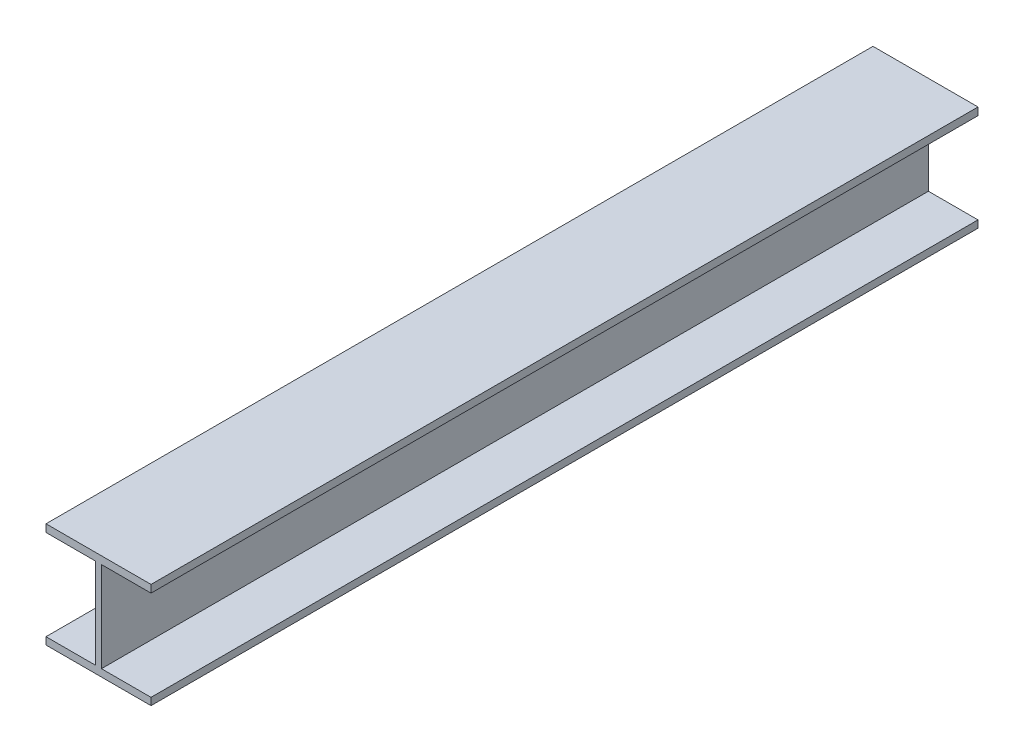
ISO-10303-21;
HEADER;
FILE_DESCRIPTION(('STEP AP214'),'2;1');
FILE_NAME('part.step','',(''),(''),'','','');
FILE_SCHEMA(('AUTOMOTIVE_DESIGN { 1 0 10303 214 1 1 1 1 }'));
ENDSEC;
DATA;
#1=APPLICATION_CONTEXT('core data for automotive mechanical design processes');
#2=APPLICATION_PROTOCOL_DEFINITION('international standard','automotive_design',2000,#1);
#3=PRODUCT_CONTEXT('',#1,'mechanical');
#4=PRODUCT('Part','Part','',(#3));
#5=PRODUCT_RELATED_PRODUCT_CATEGORY('part','',(#4));
#6=PRODUCT_DEFINITION_FORMATION('','',#4);
#7=PRODUCT_DEFINITION_CONTEXT('part definition',#1,'design');
#8=PRODUCT_DEFINITION('design','',#6,#7);
#9=PRODUCT_DEFINITION_SHAPE('','',#8);
#10=(LENGTH_UNIT() NAMED_UNIT(*) SI_UNIT(.MILLI.,.METRE.));
#11=(NAMED_UNIT(*) PLANE_ANGLE_UNIT() SI_UNIT($,.RADIAN.));
#12=(NAMED_UNIT(*) SI_UNIT($,.STERADIAN.) SOLID_ANGLE_UNIT());
#13=UNCERTAINTY_MEASURE_WITH_UNIT(LENGTH_MEASURE(1.E-05),#10,'distance_accuracy_value','');
#14=(GEOMETRIC_REPRESENTATION_CONTEXT(3) GLOBAL_UNCERTAINTY_ASSIGNED_CONTEXT((#13)) GLOBAL_UNIT_ASSIGNED_CONTEXT((#10,
#11,#12)) REPRESENTATION_CONTEXT('',''));
#15=CARTESIAN_POINT('',(0.,0.,0.));
#16=DIRECTION('',(0.,0.,1.));
#17=DIRECTION('',(1.,0.,0.));
#18=AXIS2_PLACEMENT_3D('',#15,#16,#17);
#19=CARTESIAN_POINT('',(63.5,54.36,1000.));
#20=DIRECTION('',(-1.,0.,0.));
#21=DIRECTION('',(0.,0.,1.));
#22=AXIS2_PLACEMENT_3D('',#19,#20,#21);
#23=PLANE('',#22);
#24=DIRECTION('',(0.,1.,0.));
#25=VECTOR('',#24,1.);
#26=CARTESIAN_POINT('',(63.5,54.36,0.));
#27=LINE('',#26,#25);
#28=CARTESIAN_POINT('',(63.5,54.36,0.));
#29=VERTEX_POINT('',#28);
#30=CARTESIAN_POINT('',(63.5,63.5,0.));
#31=VERTEX_POINT('',#30);
#32=EDGE_CURVE('E170',#29,#31,#27,.T.);
#33=ORIENTED_EDGE('',*,*,#32,.T.);
#34=DIRECTION('',(0.,0.,-1.));
#35=VECTOR('',#34,1.);
#36=CARTESIAN_POINT('',(63.5,63.5,1000.));
#37=LINE('',#36,#35);
#38=CARTESIAN_POINT('',(63.5,63.5,1000.));
#39=VERTEX_POINT('',#38);
#40=EDGE_CURVE('E11',#39,#31,#37,.T.);
#41=ORIENTED_EDGE('',*,*,#40,.F.);
#42=DIRECTION('',(0.,1.,0.));
#43=VECTOR('',#42,1.);
#44=CARTESIAN_POINT('',(63.5,54.36,1000.));
#45=LINE('',#44,#43);
#46=CARTESIAN_POINT('',(63.5,54.36,1000.));
#47=VERTEX_POINT('',#46);
#48=EDGE_CURVE('E204',#47,#39,#45,.T.);
#49=ORIENTED_EDGE('',*,*,#48,.F.);
#50=DIRECTION('',(0.,0.,-1.));
#51=VECTOR('',#50,1.);
#52=CARTESIAN_POINT('',(63.5,54.36,1000.));
#53=LINE('',#52,#51);
#54=EDGE_CURVE('E166',#47,#29,#53,.T.);
#55=ORIENTED_EDGE('',*,*,#54,.T.);
#56=EDGE_LOOP('',(#33,#41,#49,#55));
#57=FACE_BOUND('',#56,.T.);
#58=ADVANCED_FACE('F45',(#57),#23,.F.);
#59=CARTESIAN_POINT('',(-63.5,63.5,1000.));
#60=DIRECTION('',(0.,-1.,0.));
#61=DIRECTION('',(0.,0.,-1.));
#62=AXIS2_PLACEMENT_3D('',#59,#60,#61);
#63=PLANE('',#62);
#64=DIRECTION('',(-1.,0.,0.));
#65=VECTOR('',#64,1.);
#66=CARTESIAN_POINT('',(-63.5,63.5,0.));
#67=LINE('',#66,#65);
#68=CARTESIAN_POINT('',(-63.5,63.5,0.));
#69=VERTEX_POINT('',#68);
#70=EDGE_CURVE('E174',#31,#69,#67,.T.);
#71=ORIENTED_EDGE('',*,*,#70,.T.);
#72=DIRECTION('',(0.,0.,-1.));
#73=VECTOR('',#72,1.);
#74=CARTESIAN_POINT('',(-63.5,63.5,1000.));
#75=LINE('',#74,#73);
#76=CARTESIAN_POINT('',(-63.5,63.5,1000.));
#77=VERTEX_POINT('',#76);
#78=EDGE_CURVE('E54',#77,#69,#75,.T.);
#79=ORIENTED_EDGE('',*,*,#78,.F.);
#80=DIRECTION('',(-1.,0.,0.));
#81=VECTOR('',#80,1.);
#82=CARTESIAN_POINT('',(-63.5,63.5,1000.));
#83=LINE('',#82,#81);
#84=EDGE_CURVE('E117',#39,#77,#83,.T.);
#85=ORIENTED_EDGE('',*,*,#84,.F.);
#86=ORIENTED_EDGE('',*,*,#40,.T.);
#87=EDGE_LOOP('',(#71,#79,#85,#86));
#88=FACE_BOUND('',#87,.T.);
#89=ADVANCED_FACE('F298',(#88),#63,.F.);
#90=CARTESIAN_POINT('',(-63.5,54.36,1000.));
#91=DIRECTION('',(1.,0.,0.));
#92=DIRECTION('',(0.,0.,-1.));
#93=AXIS2_PLACEMENT_3D('',#90,#91,#92);
#94=PLANE('',#93);
#95=DIRECTION('',(0.,-1.,0.));
#96=VECTOR('',#95,1.);
#97=CARTESIAN_POINT('',(-63.5,54.36,0.));
#98=LINE('',#97,#96);
#99=CARTESIAN_POINT('',(-63.5,54.36,0.));
#100=VERTEX_POINT('',#99);
#101=EDGE_CURVE('E177',#69,#100,#98,.T.);
#102=ORIENTED_EDGE('',*,*,#101,.T.);
#103=DIRECTION('',(0.,0.,-1.));
#104=VECTOR('',#103,1.);
#105=CARTESIAN_POINT('',(-63.5,54.36,1000.));
#106=LINE('',#105,#104);
#107=CARTESIAN_POINT('',(-63.5,54.36,1000.));
#108=VERTEX_POINT('',#107);
#109=EDGE_CURVE('E231',#108,#100,#106,.T.);
#110=ORIENTED_EDGE('',*,*,#109,.F.);
#111=DIRECTION('',(0.,-1.,0.));
#112=VECTOR('',#111,1.);
#113=CARTESIAN_POINT('',(-63.5,54.36,1000.));
#114=LINE('',#113,#112);
#115=EDGE_CURVE('E241',#77,#108,#114,.T.);
#116=ORIENTED_EDGE('',*,*,#115,.F.);
#117=ORIENTED_EDGE('',*,*,#78,.T.);
#118=EDGE_LOOP('',(#102,#110,#116,#117));
#119=FACE_BOUND('',#118,.T.);
#120=ADVANCED_FACE('F239',(#119),#94,.F.);
#121=CARTESIAN_POINT('',(-3.55500000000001,54.36,1000.));
#122=DIRECTION('',(0.,1.,0.));
#123=DIRECTION('',(-1.,0.,0.));
#124=AXIS2_PLACEMENT_3D('',#121,#122,#123);
#125=PLANE('',#124);
#126=DIRECTION('',(1.,0.,0.));
#127=VECTOR('',#126,1.);
#128=CARTESIAN_POINT('',(-3.55500000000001,54.36,0.));
#129=LINE('',#128,#127);
#130=CARTESIAN_POINT('',(-3.55500000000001,54.36,0.));
#131=VERTEX_POINT('',#130);
#132=EDGE_CURVE('E180',#100,#131,#129,.T.);
#133=ORIENTED_EDGE('',*,*,#132,.T.);
#134=DIRECTION('',(0.,0.,-1.));
#135=VECTOR('',#134,1.);
#136=CARTESIAN_POINT('',(-3.55500000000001,54.36,1000.));
#137=LINE('',#136,#135);
#138=CARTESIAN_POINT('',(-3.55500000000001,54.36,1000.));
#139=VERTEX_POINT('',#138);
#140=EDGE_CURVE('E227',#139,#131,#137,.T.);
#141=ORIENTED_EDGE('',*,*,#140,.F.);
#142=DIRECTION('',(1.,0.,0.));
#143=VECTOR('',#142,1.);
#144=CARTESIAN_POINT('',(-3.55500000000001,54.36,1000.));
#145=LINE('',#144,#143);
#146=EDGE_CURVE('E260',#108,#139,#145,.T.);
#147=ORIENTED_EDGE('',*,*,#146,.F.);
#148=ORIENTED_EDGE('',*,*,#109,.T.);
#149=EDGE_LOOP('',(#133,#141,#147,#148));
#150=FACE_BOUND('',#149,.T.);
#151=ADVANCED_FACE('F250',(#150),#125,.F.);
#152=CARTESIAN_POINT('',(-3.55500000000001,54.36,1000.));
#153=DIRECTION('',(1.,0.,0.));
#154=DIRECTION('',(0.,1.,0.));
#155=AXIS2_PLACEMENT_3D('',#152,#153,#154);
#156=PLANE('',#155);
#157=DIRECTION('',(0.,-1.,0.));
#158=VECTOR('',#157,1.);
#159=CARTESIAN_POINT('',(-3.55500000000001,54.36,0.));
#160=LINE('',#159,#158);
#161=CARTESIAN_POINT('',(-3.55499999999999,-54.74,0.));
#162=VERTEX_POINT('',#161);
#163=EDGE_CURVE('E183',#131,#162,#160,.T.);
#164=ORIENTED_EDGE('',*,*,#163,.T.);
#165=DIRECTION('',(0.,0.,-1.));
#166=VECTOR('',#165,1.);
#167=CARTESIAN_POINT('',(-3.55499999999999,-54.74,1000.));
#168=LINE('',#167,#166);
#169=CARTESIAN_POINT('',(-3.55499999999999,-54.74,1000.));
#170=VERTEX_POINT('',#169);
#171=EDGE_CURVE('E223',#170,#162,#168,.T.);
#172=ORIENTED_EDGE('',*,*,#171,.F.);
#173=DIRECTION('',(0.,-1.,0.));
#174=VECTOR('',#173,1.);
#175=CARTESIAN_POINT('',(-3.55500000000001,54.36,1000.));
#176=LINE('',#175,#174);
#177=EDGE_CURVE('E256',#139,#170,#176,.T.);
#178=ORIENTED_EDGE('',*,*,#177,.F.);
#179=ORIENTED_EDGE('',*,*,#140,.T.);
#180=EDGE_LOOP('',(#164,#172,#178,#179));
#181=FACE_BOUND('',#180,.T.);
#182=ADVANCED_FACE('F254',(#181),#156,.F.);
#183=CARTESIAN_POINT('',(-63.5,-54.74,1000.));
#184=DIRECTION('',(0.,-1.,0.));
#185=DIRECTION('',(1.,0.,0.));
#186=AXIS2_PLACEMENT_3D('',#183,#184,#185);
#187=PLANE('',#186);
#188=DIRECTION('',(-1.,0.,0.));
#189=VECTOR('',#188,1.);
#190=CARTESIAN_POINT('',(-63.5,-54.74,0.));
#191=LINE('',#190,#189);
#192=CARTESIAN_POINT('',(-63.5,-54.74,0.));
#193=VERTEX_POINT('',#192);
#194=EDGE_CURVE('E186',#162,#193,#191,.T.);
#195=ORIENTED_EDGE('',*,*,#194,.T.);
#196=DIRECTION('',(0.,0.,-1.));
#197=VECTOR('',#196,1.);
#198=CARTESIAN_POINT('',(-63.5,-54.74,1000.));
#199=LINE('',#198,#197);
#200=CARTESIAN_POINT('',(-63.5,-54.74,1000.));
#201=VERTEX_POINT('',#200);
#202=EDGE_CURVE('E219',#201,#193,#199,.T.);
#203=ORIENTED_EDGE('',*,*,#202,.F.);
#204=DIRECTION('',(-1.,0.,0.));
#205=VECTOR('',#204,1.);
#206=CARTESIAN_POINT('',(-63.5,-54.74,1000.));
#207=LINE('',#206,#205);
#208=EDGE_CURVE('E259',#170,#201,#207,.T.);
#209=ORIENTED_EDGE('',*,*,#208,.F.);
#210=ORIENTED_EDGE('',*,*,#171,.T.);
#211=EDGE_LOOP('',(#195,#203,#209,#210));
#212=FACE_BOUND('',#211,.T.);
#213=ADVANCED_FACE('F311',(#212),#187,.F.);
#214=CARTESIAN_POINT('',(-63.5,-63.5,1000.));
#215=DIRECTION('',(1.,0.,0.));
#216=DIRECTION('',(0.,0.,-1.));
#217=AXIS2_PLACEMENT_3D('',#214,#215,#216);
#218=PLANE('',#217);
#219=DIRECTION('',(0.,-1.,0.));
#220=VECTOR('',#219,1.);
#221=CARTESIAN_POINT('',(-63.5,-63.5,0.));
#222=LINE('',#221,#220);
#223=CARTESIAN_POINT('',(-63.5,-63.5,0.));
#224=VERTEX_POINT('',#223);
#225=EDGE_CURVE('E189',#193,#224,#222,.T.);
#226=ORIENTED_EDGE('',*,*,#225,.T.);
#227=DIRECTION('',(0.,0.,-1.));
#228=VECTOR('',#227,1.);
#229=CARTESIAN_POINT('',(-63.5,-63.5,1000.));
#230=LINE('',#229,#228);
#231=CARTESIAN_POINT('',(-63.5,-63.5,1000.));
#232=VERTEX_POINT('',#231);
#233=EDGE_CURVE('E215',#232,#224,#230,.T.);
#234=ORIENTED_EDGE('',*,*,#233,.F.);
#235=DIRECTION('',(0.,-1.,0.));
#236=VECTOR('',#235,1.);
#237=CARTESIAN_POINT('',(-63.5,-63.5,1000.));
#238=LINE('',#237,#236);
#239=EDGE_CURVE('E264',#201,#232,#238,.T.);
#240=ORIENTED_EDGE('',*,*,#239,.F.);
#241=ORIENTED_EDGE('',*,*,#202,.T.);
#242=EDGE_LOOP('',(#226,#234,#240,#241));
#243=FACE_BOUND('',#242,.T.);
#244=ADVANCED_FACE('F314',(#243),#218,.F.);
#245=CARTESIAN_POINT('',(-63.5,-63.5,1000.));
#246=DIRECTION('',(0.,1.,0.));
#247=DIRECTION('',(0.,0.,1.));
#248=AXIS2_PLACEMENT_3D('',#245,#246,#247);
#249=PLANE('',#248);
#250=DIRECTION('',(1.,0.,0.));
#251=VECTOR('',#250,1.);
#252=CARTESIAN_POINT('',(-63.5,-63.5,0.));
#253=LINE('',#252,#251);
#254=CARTESIAN_POINT('',(63.5,-63.5,0.));
#255=VERTEX_POINT('',#254);
#256=EDGE_CURVE('E192',#224,#255,#253,.T.);
#257=ORIENTED_EDGE('',*,*,#256,.T.);
#258=DIRECTION('',(0.,0.,-1.));
#259=VECTOR('',#258,1.);
#260=CARTESIAN_POINT('',(63.5,-63.5,1000.));
#261=LINE('',#260,#259);
#262=CARTESIAN_POINT('',(63.5,-63.5,1000.));
#263=VERTEX_POINT('',#262);
#264=EDGE_CURVE('E211',#263,#255,#261,.T.);
#265=ORIENTED_EDGE('',*,*,#264,.F.);
#266=DIRECTION('',(1.,0.,0.));
#267=VECTOR('',#266,1.);
#268=CARTESIAN_POINT('',(-63.5,-63.5,1000.));
#269=LINE('',#268,#267);
#270=EDGE_CURVE('E271',#232,#263,#269,.T.);
#271=ORIENTED_EDGE('',*,*,#270,.F.);
#272=ORIENTED_EDGE('',*,*,#233,.T.);
#273=EDGE_LOOP('',(#257,#265,#271,#272));
#274=FACE_BOUND('',#273,.T.);
#275=ADVANCED_FACE('F279',(#274),#249,.F.);
#276=CARTESIAN_POINT('',(63.5,-63.5,1000.));
#277=DIRECTION('',(-1.,0.,0.));
#278=DIRECTION('',(0.,0.,1.));
#279=AXIS2_PLACEMENT_3D('',#276,#277,#278);
#280=PLANE('',#279);
#281=DIRECTION('',(0.,1.,0.));
#282=VECTOR('',#281,1.);
#283=CARTESIAN_POINT('',(63.5,-63.5,0.));
#284=LINE('',#283,#282);
#285=CARTESIAN_POINT('',(63.5,-54.74,0.));
#286=VERTEX_POINT('',#285);
#287=EDGE_CURVE('E195',#255,#286,#284,.T.);
#288=ORIENTED_EDGE('',*,*,#287,.T.);
#289=DIRECTION('',(0.,0.,-1.));
#290=VECTOR('',#289,1.);
#291=CARTESIAN_POINT('',(63.5,-54.74,1000.));
#292=LINE('',#291,#290);
#293=CARTESIAN_POINT('',(63.5,-54.74,1000.));
#294=VERTEX_POINT('',#293);
#295=EDGE_CURVE('E159',#294,#286,#292,.T.);
#296=ORIENTED_EDGE('',*,*,#295,.F.);
#297=DIRECTION('',(0.,1.,0.));
#298=VECTOR('',#297,1.);
#299=CARTESIAN_POINT('',(63.5,-63.5,1000.));
#300=LINE('',#299,#298);
#301=EDGE_CURVE('E148',#263,#294,#300,.T.);
#302=ORIENTED_EDGE('',*,*,#301,.F.);
#303=ORIENTED_EDGE('',*,*,#264,.T.);
#304=EDGE_LOOP('',(#288,#296,#302,#303));
#305=FACE_BOUND('',#304,.T.);
#306=ADVANCED_FACE('F283',(#305),#280,.F.);
#307=CARTESIAN_POINT('',(3.55500000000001,-54.74,1000.));
#308=DIRECTION('',(0.,-1.,0.));
#309=DIRECTION('',(0.,0.,-1.));
#310=AXIS2_PLACEMENT_3D('',#307,#308,#309);
#311=PLANE('',#310);
#312=DIRECTION('',(-1.,0.,0.));
#313=VECTOR('',#312,1.);
#314=CARTESIAN_POINT('',(3.55500000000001,-54.74,0.));
#315=LINE('',#314,#313);
#316=CARTESIAN_POINT('',(3.55500000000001,-54.74,0.));
#317=VERTEX_POINT('',#316);
#318=EDGE_CURVE('E157',#286,#317,#315,.T.);
#319=ORIENTED_EDGE('',*,*,#318,.T.);
#320=DIRECTION('',(0.,0.,-1.));
#321=VECTOR('',#320,1.);
#322=CARTESIAN_POINT('',(3.55500000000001,-54.74,1000.));
#323=LINE('',#322,#321);
#324=CARTESIAN_POINT('',(3.55500000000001,-54.74,1000.));
#325=VERTEX_POINT('',#324);
#326=EDGE_CURVE('E154',#325,#317,#323,.T.);
#327=ORIENTED_EDGE('',*,*,#326,.F.);
#328=DIRECTION('',(-1.,0.,0.));
#329=VECTOR('',#328,1.);
#330=CARTESIAN_POINT('',(3.55500000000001,-54.74,1000.));
#331=LINE('',#330,#329);
#332=EDGE_CURVE('E142',#294,#325,#331,.T.);
#333=ORIENTED_EDGE('',*,*,#332,.F.);
#334=ORIENTED_EDGE('',*,*,#295,.T.);
#335=EDGE_LOOP('',(#319,#327,#333,#334));
#336=FACE_BOUND('',#335,.T.);
#337=ADVANCED_FACE('F155',(#336),#311,.F.);
#338=CARTESIAN_POINT('',(3.55500000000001,-54.74,1000.));
#339=DIRECTION('',(-1.,0.,0.));
#340=DIRECTION('',(0.,-1.,0.));
#341=AXIS2_PLACEMENT_3D('',#338,#339,#340);
#342=PLANE('',#341);
#343=DIRECTION('',(0.,1.,0.));
#344=VECTOR('',#343,1.);
#345=CARTESIAN_POINT('',(3.55500000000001,-54.74,0.));
#346=LINE('',#345,#344);
#347=CARTESIAN_POINT('',(3.55500000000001,54.36,0.));
#348=VERTEX_POINT('',#347);
#349=EDGE_CURVE('E103',#317,#348,#346,.T.);
#350=ORIENTED_EDGE('',*,*,#349,.T.);
#351=DIRECTION('',(0.,0.,-1.));
#352=VECTOR('',#351,1.);
#353=CARTESIAN_POINT('',(3.55500000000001,54.36,1000.));
#354=LINE('',#353,#352);
#355=CARTESIAN_POINT('',(3.55500000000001,54.36,1000.));
#356=VERTEX_POINT('',#355);
#357=EDGE_CURVE('E160',#356,#348,#354,.T.);
#358=ORIENTED_EDGE('',*,*,#357,.F.);
#359=DIRECTION('',(0.,1.,0.));
#360=VECTOR('',#359,1.);
#361=CARTESIAN_POINT('',(3.55500000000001,-54.74,1000.));
#362=LINE('',#361,#360);
#363=EDGE_CURVE('E146',#325,#356,#362,.T.);
#364=ORIENTED_EDGE('',*,*,#363,.F.);
#365=ORIENTED_EDGE('',*,*,#326,.T.);
#366=EDGE_LOOP('',(#350,#358,#364,#365));
#367=FACE_BOUND('',#366,.T.);
#368=ADVANCED_FACE('F162',(#367),#342,.F.);
#369=CARTESIAN_POINT('',(63.5,54.36,1000.));
#370=DIRECTION('',(0.,1.,0.));
#371=DIRECTION('',(0.,0.,1.));
#372=AXIS2_PLACEMENT_3D('',#369,#370,#371);
#373=PLANE('',#372);
#374=DIRECTION('',(1.,0.,0.));
#375=VECTOR('',#374,1.);
#376=CARTESIAN_POINT('',(63.5,54.36,0.));
#377=LINE('',#376,#375);
#378=EDGE_CURVE('E109',#348,#29,#377,.T.);
#379=ORIENTED_EDGE('',*,*,#378,.T.);
#380=ORIENTED_EDGE('',*,*,#54,.F.);
#381=DIRECTION('',(1.,0.,0.));
#382=VECTOR('',#381,1.);
#383=CARTESIAN_POINT('',(63.5,54.36,1000.));
#384=LINE('',#383,#382);
#385=EDGE_CURVE('E62',#356,#47,#384,.T.);
#386=ORIENTED_EDGE('',*,*,#385,.F.);
#387=ORIENTED_EDGE('',*,*,#357,.T.);
#388=EDGE_LOOP('',(#379,#380,#386,#387));
#389=FACE_BOUND('',#388,.T.);
#390=ADVANCED_FACE('F287',(#389),#373,.F.);
#391=CARTESIAN_POINT('',(0.,0.,1000.));
#392=DIRECTION('',(0.,0.,-1.));
#393=DIRECTION('',(-1.,0.,0.));
#394=AXIS2_PLACEMENT_3D('',#391,#392,#393);
#395=PLANE('',#394);
#396=ORIENTED_EDGE('',*,*,#48,.T.);
#397=ORIENTED_EDGE('',*,*,#84,.T.);
#398=ORIENTED_EDGE('',*,*,#115,.T.);
#399=ORIENTED_EDGE('',*,*,#146,.T.);
#400=ORIENTED_EDGE('',*,*,#177,.T.);
#401=ORIENTED_EDGE('',*,*,#208,.T.);
#402=ORIENTED_EDGE('',*,*,#239,.T.);
#403=ORIENTED_EDGE('',*,*,#270,.T.);
#404=ORIENTED_EDGE('',*,*,#301,.T.);
#405=ORIENTED_EDGE('',*,*,#332,.T.);
#406=ORIENTED_EDGE('',*,*,#363,.T.);
#407=ORIENTED_EDGE('',*,*,#385,.T.);
#408=EDGE_LOOP('',(#396,#397,#398,#399,#400,#401,#402,#403,#404,#405,#406,#407));
#409=FACE_BOUND('',#408,.T.);
#410=ADVANCED_FACE('F144',(#409),#395,.F.);
#411=CARTESIAN_POINT('',(0.,0.,0.));
#412=DIRECTION('',(0.,0.,-1.));
#413=DIRECTION('',(-1.,0.,0.));
#414=AXIS2_PLACEMENT_3D('',#411,#412,#413);
#415=PLANE('',#414);
#416=ORIENTED_EDGE('',*,*,#32,.F.);
#417=ORIENTED_EDGE('',*,*,#378,.F.);
#418=ORIENTED_EDGE('',*,*,#349,.F.);
#419=ORIENTED_EDGE('',*,*,#318,.F.);
#420=ORIENTED_EDGE('',*,*,#287,.F.);
#421=ORIENTED_EDGE('',*,*,#256,.F.);
#422=ORIENTED_EDGE('',*,*,#225,.F.);
#423=ORIENTED_EDGE('',*,*,#194,.F.);
#424=ORIENTED_EDGE('',*,*,#163,.F.);
#425=ORIENTED_EDGE('',*,*,#132,.F.);
#426=ORIENTED_EDGE('',*,*,#101,.F.);
#427=ORIENTED_EDGE('',*,*,#70,.F.);
#428=EDGE_LOOP('',(#416,#417,#418,#419,#420,#421,#422,#423,#424,#425,#426,#427));
#429=FACE_BOUND('',#428,.T.);
#430=ADVANCED_FACE('F245',(#429),#415,.T.);
#431=CLOSED_SHELL('',(#58,#89,#120,#151,#182,#213,#244,#275,#306,#337,#368,#390,#410,#430));
#432=MANIFOLD_SOLID_BREP('B2',#431);
#433=ADVANCED_BREP_SHAPE_REPRESENTATION('',(#18,#432),#14);
#434=SHAPE_DEFINITION_REPRESENTATION(#9,#433);
ENDSEC;
END-ISO-10303-21;
